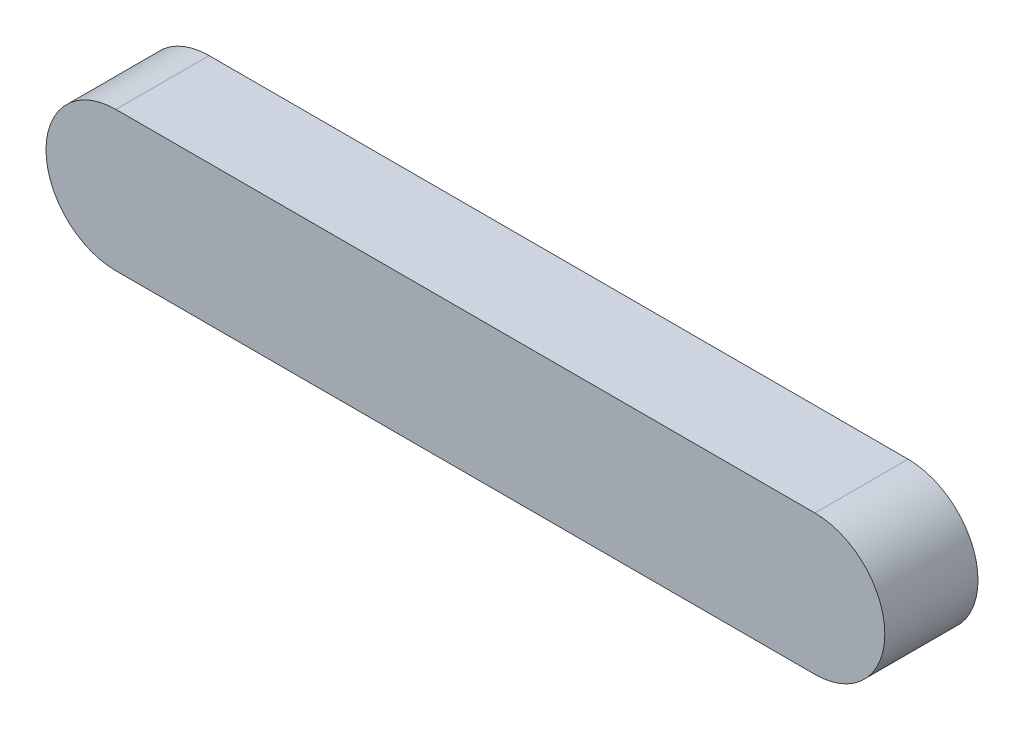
from build123d import *

# Parameters (mm, degrees)
EXTRUSION1_DEPTH = 4


with BuildPart() as part:
    # Esquisse1 → Extrusion1 (new body)
    with BuildSketch(Plane.XY):
        with BuildLine():
            Line((0, 3), (30, 3))
            ThreePointArc((30, 3), (33, 0), (30, -3))
            Line((30, -3), (0, -3))
            ThreePointArc((0, -3), (-3, 0), (0, 3))
        make_face()
    extrude(amount=EXTRUSION1_DEPTH)


solid = part.part
